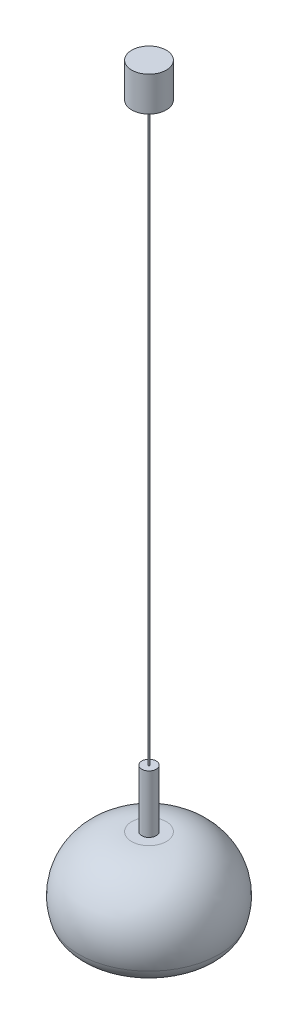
ISO-10303-21;
HEADER;
FILE_DESCRIPTION(('STEP AP214'),'2;1');
FILE_NAME('part.step','',(''),(''),'','','');
FILE_SCHEMA(('AUTOMOTIVE_DESIGN { 1 0 10303 214 1 1 1 1 }'));
ENDSEC;
DATA;
#1=APPLICATION_CONTEXT('core data for automotive mechanical design processes');
#2=APPLICATION_PROTOCOL_DEFINITION('international standard','automotive_design',2000,#1);
#3=PRODUCT_CONTEXT('',#1,'mechanical');
#4=PRODUCT('Part','Part','',(#3));
#5=PRODUCT_RELATED_PRODUCT_CATEGORY('part','',(#4));
#6=PRODUCT_DEFINITION_FORMATION('','',#4);
#7=PRODUCT_DEFINITION_CONTEXT('part definition',#1,'design');
#8=PRODUCT_DEFINITION('design','',#6,#7);
#9=PRODUCT_DEFINITION_SHAPE('','',#8);
#10=(LENGTH_UNIT() NAMED_UNIT(*) SI_UNIT(.MILLI.,.METRE.));
#11=(NAMED_UNIT(*) PLANE_ANGLE_UNIT() SI_UNIT($,.RADIAN.));
#12=(NAMED_UNIT(*) SI_UNIT($,.STERADIAN.) SOLID_ANGLE_UNIT());
#13=UNCERTAINTY_MEASURE_WITH_UNIT(LENGTH_MEASURE(1.E-05),#10,'distance_accuracy_value','');
#14=(GEOMETRIC_REPRESENTATION_CONTEXT(3) GLOBAL_UNCERTAINTY_ASSIGNED_CONTEXT((#13)) GLOBAL_UNIT_ASSIGNED_CONTEXT((#10,
#11,#12)) REPRESENTATION_CONTEXT('',''));
#15=CARTESIAN_POINT('',(0.,0.,0.));
#16=DIRECTION('',(0.,0.,1.));
#17=DIRECTION('',(1.,0.,0.));
#18=AXIS2_PLACEMENT_3D('',#15,#16,#17);
#19=CARTESIAN_POINT('',(-13.9638529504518,21.1647534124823,251.88578006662));
#20=DIRECTION('',(0.,0.,-1.));
#21=DIRECTION('',(-1.,0.,0.));
#22=AXIS2_PLACEMENT_3D('',#19,#20,#21);
#23=CIRCLE('',#22,40.);
#24=TRIMMED_CURVE('',#23,(PARAMETER_VALUE(-1.61579062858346)),
(PARAMETER_VALUE(1.61579062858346)),.T.,.PARAMETER.);
#25=CARTESIAN_POINT('',(-12.1646880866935,21.1647534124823,251.88578006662));
#26=DIRECTION('',(0.,1.,0.));
#27=AXIS1_PLACEMENT('',#25,#26);
#28=SURFACE_OF_REVOLUTION('',#24,#27);
#29=CARTESIAN_POINT('',(-12.1646880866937,59.1303600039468,251.88578006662));
#30=DIRECTION('',(0.,1.,0.));
#31=DIRECTION('',(-1.,0.,0.));
#32=AXIS2_PLACEMENT_3D('',#29,#30,#31);
#33=CIRCLE('',#32,14.3933189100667);
#34=CARTESIAN_POINT('',(-26.5580069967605,59.1303600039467,251.88578006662));
#35=VERTEX_POINT('',#34);
#36=EDGE_CURVE('P0_E11',#35,#35,#33,.T.);
#37=ORIENTED_EDGE('',*,*,#36,.F.);
#38=EDGE_LOOP('',(#37));
#39=FACE_BOUND('',#38,.T.);
#40=CARTESIAN_POINT('',(-12.1646880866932,-18.7947636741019,251.88578006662));
#41=VERTEX_POINT('',#40);
#42=VERTEX_LOOP('',#41);
#43=FACE_BOUND('',#42,.T.);
#44=ADVANCED_FACE('P0_F17',(#39,#43),#28,.T.);
#45=CARTESIAN_POINT('',(2.22863082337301,59.1303600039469,251.88578006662));
#46=DIRECTION('',(0.,-1.,0.));
#47=DIRECTION('',(1.,0.,0.));
#48=AXIS2_PLACEMENT_3D('',#45,#46,#47);
#49=PLANE('',#48);
#50=ORIENTED_EDGE('',*,*,#36,.T.);
#51=EDGE_LOOP('',(#50));
#52=FACE_BOUND('',#51,.T.);
#53=ADVANCED_FACE('P0_F25',(#52),#49,.F.);
#54=CLOSED_SHELL('',(#44,#53));
#55=MANIFOLD_SOLID_BREP('P0_B1',#54);
#56=CARTESIAN_POINT('',(-12.1646880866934,101.130360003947,251.88578006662));
#57=DIRECTION('',(0.,1.,0.));
#58=DIRECTION('',(-1.,0.,0.));
#59=AXIS2_PLACEMENT_3D('',#56,#57,#58);
#60=PLANE('',#59);
#61=CARTESIAN_POINT('',(-12.1646880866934,101.130360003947,251.88578006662));
#62=DIRECTION('',(0.,1.,0.));
#63=DIRECTION('',(0.,0.,1.));
#64=AXIS2_PLACEMENT_3D('',#61,#62,#63);
#65=CIRCLE('',#64,12.5);
#66=CARTESIAN_POINT('',(-12.1646880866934,101.130360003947,264.38578006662));
#67=VERTEX_POINT('',#66);
#68=EDGE_CURVE('P1_E40',#67,#67,#65,.T.);
#69=ORIENTED_EDGE('',*,*,#68,.F.);
#70=EDGE_LOOP('',(#69));
#71=FACE_BOUND('',#70,.T.);
#72=CARTESIAN_POINT('',(-12.1646880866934,101.130360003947,251.88578006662));
#73=DIRECTION('',(0.,-1.,0.));
#74=DIRECTION('',(1.,0.,0.));
#75=AXIS2_PLACEMENT_3D('',#72,#73,#74);
#76=CIRCLE('',#75,30.);
#77=CARTESIAN_POINT('',(17.8353119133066,101.130360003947,251.88578006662));
#78=VERTEX_POINT('',#77);
#79=EDGE_CURVE('P1_E10',#78,#78,#76,.T.);
#80=ORIENTED_EDGE('',*,*,#79,.F.);
#81=EDGE_LOOP('',(#80));
#82=FACE_BOUND('',#81,.T.);
#83=ADVANCED_FACE('P1_F15',(#71,#82),#60,.T.);
#84=CARTESIAN_POINT('',(-12.1646880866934,5.18746997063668,251.88578006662));
#85=DIRECTION('',(0.,-1.,0.));
#86=DIRECTION('',(1.,0.,0.));
#87=AXIS2_PLACEMENT_3D('',#84,#85,#86);
#88=DEGENERATE_TOROIDAL_SURFACE('',#87,30.,95.9428900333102,.T.);
#89=ORIENTED_EDGE('',*,*,#79,.T.);
#90=EDGE_LOOP('',(#89));
#91=FACE_BOUND('',#90,.T.);
#92=CARTESIAN_POINT('',(-12.1646880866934,-22.6792566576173,251.88578006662));
#93=DIRECTION('',(0.,-1.,0.));
#94=DIRECTION('',(1.,0.,0.));
#95=AXIS2_PLACEMENT_3D('',#92,#93,#94);
#96=CIRCLE('',#95,121.806773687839);
#97=CARTESIAN_POINT('',(109.642085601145,-22.6792566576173,251.88578006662));
#98=VERTEX_POINT('',#97);
#99=EDGE_CURVE('P1_E22',#98,#98,#96,.T.);
#100=ORIENTED_EDGE('',*,*,#99,.F.);
#101=EDGE_LOOP('',(#100));
#102=FACE_BOUND('',#101,.T.);
#103=ADVANCED_FACE('P1_F68',(#91,#102),#88,.T.);
#104=CARTESIAN_POINT('',(-12.1646880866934,-11.0612090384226,251.88578006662));
#105=DIRECTION('',(0.,-1.,0.));
#106=DIRECTION('',(1.,0.,0.));
#107=AXIS2_PLACEMENT_3D('',#104,#105,#106);
#108=TOROIDAL_SURFACE('',#107,83.531181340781,40.0000000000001);
#109=ORIENTED_EDGE('',*,*,#99,.T.);
#110=EDGE_LOOP('',(#109));
#111=FACE_BOUND('',#110,.T.);
#112=CARTESIAN_POINT('',(-12.1646880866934,-51.0612090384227,251.88578006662));
#113=DIRECTION('',(0.,-1.,0.));
#114=DIRECTION('',(1.,0.,0.));
#115=AXIS2_PLACEMENT_3D('',#112,#113,#114);
#116=CIRCLE('',#115,83.531181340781);
#117=CARTESIAN_POINT('',(71.3664932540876,-51.0612090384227,251.88578006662));
#118=VERTEX_POINT('',#117);
#119=EDGE_CURVE('P1_E26',#118,#118,#116,.T.);
#120=ORIENTED_EDGE('',*,*,#119,.F.);
#121=EDGE_LOOP('',(#120));
#122=FACE_BOUND('',#121,.T.);
#123=ADVANCED_FACE('P1_F73',(#111,#122),#108,.T.);
#124=CARTESIAN_POINT('',(-12.1646880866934,-50.0612090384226,251.88578006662));
#125=DIRECTION('',(0.,-1.,0.));
#126=DIRECTION('',(1.,0.,0.));
#127=AXIS2_PLACEMENT_3D('',#124,#125,#126);
#128=TOROIDAL_SURFACE('',#127,83.531181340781,1.00000000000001);
#129=ORIENTED_EDGE('',*,*,#119,.T.);
#130=EDGE_LOOP('',(#129));
#131=FACE_BOUND('',#130,.T.);
#132=CARTESIAN_POINT('',(-12.1646880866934,-49.0612090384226,251.88578006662));
#133=DIRECTION('',(0.,-1.,0.));
#134=DIRECTION('',(1.,0.,0.));
#135=AXIS2_PLACEMENT_3D('',#132,#133,#134);
#136=CIRCLE('',#135,83.531181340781);
#137=CARTESIAN_POINT('',(71.3664932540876,-49.0612090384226,251.88578006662));
#138=VERTEX_POINT('',#137);
#139=EDGE_CURVE('P1_E31',#138,#138,#136,.T.);
#140=ORIENTED_EDGE('',*,*,#139,.F.);
#141=EDGE_LOOP('',(#140));
#142=FACE_BOUND('',#141,.T.);
#143=ADVANCED_FACE('P1_F64',(#131,#142),#128,.T.);
#144=CARTESIAN_POINT('',(-12.1646880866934,-11.0612090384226,251.88578006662));
#145=DIRECTION('',(0.,-1.,0.));
#146=DIRECTION('',(1.,0.,0.));
#147=AXIS2_PLACEMENT_3D('',#144,#145,#146);
#148=TOROIDAL_SURFACE('',#147,83.531181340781,38.0000000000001);
#149=ORIENTED_EDGE('',*,*,#139,.T.);
#150=EDGE_LOOP('',(#149));
#151=FACE_BOUND('',#150,.T.);
#152=CARTESIAN_POINT('',(-12.1646880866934,-22.0983542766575,251.88578006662));
#153=DIRECTION('',(0.,-1.,0.));
#154=DIRECTION('',(1.,0.,0.));
#155=AXIS2_PLACEMENT_3D('',#152,#153,#154);
#156=CIRCLE('',#155,119.892994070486);
#157=CARTESIAN_POINT('',(107.728305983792,-22.0983542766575,251.88578006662));
#158=VERTEX_POINT('',#157);
#159=EDGE_CURVE('P1_E34',#158,#158,#156,.T.);
#160=ORIENTED_EDGE('',*,*,#159,.F.);
#161=EDGE_LOOP('',(#160));
#162=FACE_BOUND('',#161,.T.);
#163=ADVANCED_FACE('P1_F57',(#151,#162),#148,.F.);
#164=CARTESIAN_POINT('',(-12.1646880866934,5.18746997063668,251.88578006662));
#165=DIRECTION('',(0.,-1.,0.));
#166=DIRECTION('',(1.,0.,0.));
#167=AXIS2_PLACEMENT_3D('',#164,#165,#166);
#168=DEGENERATE_TOROIDAL_SURFACE('',#167,30.,93.9428900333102,.T.);
#169=ORIENTED_EDGE('',*,*,#159,.T.);
#170=EDGE_LOOP('',(#169));
#171=FACE_BOUND('',#170,.T.);
#172=CARTESIAN_POINT('',(-12.1646880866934,99.1303600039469,251.88578006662));
#173=DIRECTION('',(0.,-1.,0.));
#174=DIRECTION('',(1.,0.,0.));
#175=AXIS2_PLACEMENT_3D('',#172,#173,#174);
#176=CIRCLE('',#175,30.);
#177=CARTESIAN_POINT('',(17.8353119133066,99.1303600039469,251.88578006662));
#178=VERTEX_POINT('',#177);
#179=EDGE_CURVE('P1_E37',#178,#178,#176,.T.);
#180=ORIENTED_EDGE('',*,*,#179,.F.);
#181=EDGE_LOOP('',(#180));
#182=FACE_BOUND('',#181,.T.);
#183=ADVANCED_FACE('P1_F52',(#171,#182),#168,.F.);
#184=CARTESIAN_POINT('',(-12.1646880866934,99.1303600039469,251.88578006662));
#185=DIRECTION('',(0.,-1.,0.));
#186=DIRECTION('',(1.,0.,0.));
#187=AXIS2_PLACEMENT_3D('',#184,#185,#186);
#188=PLANE('',#187);
#189=CARTESIAN_POINT('',(-12.1646880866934,99.1303600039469,251.88578006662));
#190=DIRECTION('',(0.,-1.,0.));
#191=DIRECTION('',(1.,0.,0.));
#192=AXIS2_PLACEMENT_3D('',#189,#190,#191);
#193=CIRCLE('',#192,12.5);
#194=CARTESIAN_POINT('',(0.335311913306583,99.1303600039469,251.88578006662));
#195=VERTEX_POINT('',#194);
#196=EDGE_CURVE('P1_E18',#195,#195,#193,.T.);
#197=ORIENTED_EDGE('',*,*,#196,.F.);
#198=EDGE_LOOP('',(#197));
#199=FACE_BOUND('',#198,.T.);
#200=ORIENTED_EDGE('',*,*,#179,.T.);
#201=EDGE_LOOP('',(#200));
#202=FACE_BOUND('',#201,.T.);
#203=ADVANCED_FACE('P1_F49',(#199,#202),#188,.T.);
#204=CARTESIAN_POINT('',(-12.1646880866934,69.1303600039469,251.88578006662));
#205=DIRECTION('',(0.,1.,0.));
#206=DIRECTION('',(0.,0.,1.));
#207=AXIS2_PLACEMENT_3D('',#204,#205,#206);
#208=CYLINDRICAL_SURFACE('',#207,12.5);
#209=ORIENTED_EDGE('',*,*,#196,.T.);
#210=EDGE_LOOP('',(#209));
#211=FACE_BOUND('',#210,.T.);
#212=ORIENTED_EDGE('',*,*,#68,.T.);
#213=EDGE_LOOP('',(#212));
#214=FACE_BOUND('',#213,.T.);
#215=ADVANCED_FACE('P1_F47',(#211,#214),#208,.F.);
#216=CLOSED_SHELL('',(#83,#103,#123,#143,#163,#183,#203,#215));
#217=MANIFOLD_SOLID_BREP('P1_B1',#216);
#218=CARTESIAN_POINT('',(-12.1646880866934,1261.13036000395,251.88578006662));
#219=DIRECTION('',(0.,-1.,0.));
#220=DIRECTION('',(0.,0.,-1.));
#221=AXIS2_PLACEMENT_3D('',#218,#219,#220);
#222=CYLINDRICAL_SURFACE('',#221,30.);
#223=CARTESIAN_POINT('',(-12.1646880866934,1261.13036000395,251.88578006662));
#224=DIRECTION('',(0.,1.,0.));
#225=DIRECTION('',(0.,0.,1.));
#226=AXIS2_PLACEMENT_3D('',#223,#224,#225);
#227=CIRCLE('',#226,30.);
#228=CARTESIAN_POINT('',(-12.1646880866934,1261.13036000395,281.88578006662));
#229=VERTEX_POINT('',#228);
#230=EDGE_CURVE('P2_E9',#229,#229,#227,.T.);
#231=ORIENTED_EDGE('',*,*,#230,.F.);
#232=EDGE_LOOP('',(#231));
#233=FACE_BOUND('',#232,.T.);
#234=CARTESIAN_POINT('',(-12.1646880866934,1201.13036000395,251.88578006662));
#235=DIRECTION('',(0.,1.,0.));
#236=DIRECTION('',(0.,0.,1.));
#237=AXIS2_PLACEMENT_3D('',#234,#235,#236);
#238=CIRCLE('',#237,30.);
#239=CARTESIAN_POINT('',(-12.1646880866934,1201.13036000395,281.88578006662));
#240=VERTEX_POINT('',#239);
#241=EDGE_CURVE('P2_E17',#240,#240,#238,.T.);
#242=ORIENTED_EDGE('',*,*,#241,.T.);
#243=EDGE_LOOP('',(#242));
#244=FACE_BOUND('',#243,.T.);
#245=ADVANCED_FACE('P2_F14',(#233,#244),#222,.T.);
#246=CARTESIAN_POINT('',(-12.1646880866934,1261.13036000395,251.88578006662));
#247=DIRECTION('',(0.,1.,0.));
#248=DIRECTION('',(0.,0.,1.));
#249=AXIS2_PLACEMENT_3D('',#246,#247,#248);
#250=PLANE('',#249);
#251=ORIENTED_EDGE('',*,*,#230,.T.);
#252=EDGE_LOOP('',(#251));
#253=FACE_BOUND('',#252,.T.);
#254=ADVANCED_FACE('P2_F29',(#253),#250,.T.);
#255=CARTESIAN_POINT('',(-12.1646880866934,1201.13036000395,251.88578006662));
#256=DIRECTION('',(0.,1.,0.));
#257=DIRECTION('',(0.,0.,1.));
#258=AXIS2_PLACEMENT_3D('',#255,#256,#257);
#259=PLANE('',#258);
#260=ORIENTED_EDGE('',*,*,#241,.F.);
#261=EDGE_LOOP('',(#260));
#262=FACE_BOUND('',#261,.T.);
#263=ADVANCED_FACE('P2_F27',(#262),#259,.F.);
#264=CLOSED_SHELL('',(#245,#254,#263));
#265=MANIFOLD_SOLID_BREP('P2_B1',#264);
#266=CARTESIAN_POINT('',(-12.1646880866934,1201.13036000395,251.88578006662));
#267=DIRECTION('',(0.,-1.,0.));
#268=DIRECTION('',(0.,0.,-1.));
#269=AXIS2_PLACEMENT_3D('',#266,#267,#268);
#270=CYLINDRICAL_SURFACE('',#269,1.5);
#271=CARTESIAN_POINT('',(-12.1646880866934,1201.13036000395,251.88578006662));
#272=DIRECTION('',(0.,1.,0.));
#273=DIRECTION('',(0.,0.,1.));
#274=AXIS2_PLACEMENT_3D('',#271,#272,#273);
#275=CIRCLE('',#274,1.5);
#276=CARTESIAN_POINT('',(-12.1646880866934,1201.13036000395,253.38578006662));
#277=VERTEX_POINT('',#276);
#278=EDGE_CURVE('P3_E10',#277,#277,#275,.T.);
#279=ORIENTED_EDGE('',*,*,#278,.F.);
#280=EDGE_LOOP('',(#279));
#281=FACE_BOUND('',#280,.T.);
#282=CARTESIAN_POINT('',(-12.1646880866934,201.130360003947,251.88578006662));
#283=DIRECTION('',(0.,1.,0.));
#284=DIRECTION('',(0.,0.,1.));
#285=AXIS2_PLACEMENT_3D('',#282,#283,#284);
#286=CIRCLE('',#285,1.5);
#287=CARTESIAN_POINT('',(-12.1646880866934,201.130360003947,253.38578006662));
#288=VERTEX_POINT('',#287);
#289=EDGE_CURVE('P3_E18',#288,#288,#286,.T.);
#290=ORIENTED_EDGE('',*,*,#289,.T.);
#291=EDGE_LOOP('',(#290));
#292=FACE_BOUND('',#291,.T.);
#293=ADVANCED_FACE('P3_F15',(#281,#292),#270,.T.);
#294=CARTESIAN_POINT('',(-12.1646880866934,1201.13036000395,251.88578006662));
#295=DIRECTION('',(0.,1.,0.));
#296=DIRECTION('',(0.,0.,1.));
#297=AXIS2_PLACEMENT_3D('',#294,#295,#296);
#298=PLANE('',#297);
#299=ORIENTED_EDGE('',*,*,#278,.T.);
#300=EDGE_LOOP('',(#299));
#301=FACE_BOUND('',#300,.T.);
#302=ADVANCED_FACE('P3_F30',(#301),#298,.T.);
#303=CARTESIAN_POINT('',(-12.1646880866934,201.130360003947,251.88578006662));
#304=DIRECTION('',(0.,1.,0.));
#305=DIRECTION('',(0.,0.,1.));
#306=AXIS2_PLACEMENT_3D('',#303,#304,#305);
#307=PLANE('',#306);
#308=ORIENTED_EDGE('',*,*,#289,.F.);
#309=EDGE_LOOP('',(#308));
#310=FACE_BOUND('',#309,.T.);
#311=ADVANCED_FACE('P3_F28',(#310),#307,.F.);
#312=CLOSED_SHELL('',(#293,#302,#311));
#313=MANIFOLD_SOLID_BREP('P3_B1',#312);
#314=CARTESIAN_POINT('',(-12.1646880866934,201.130360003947,251.88578006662));
#315=DIRECTION('',(0.,-1.,0.));
#316=DIRECTION('',(0.,0.,-1.));
#317=AXIS2_PLACEMENT_3D('',#314,#315,#316);
#318=CYLINDRICAL_SURFACE('',#317,12.5);
#319=CARTESIAN_POINT('',(-12.1646880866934,201.130360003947,251.88578006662));
#320=DIRECTION('',(0.,1.,0.));
#321=DIRECTION('',(0.,0.,1.));
#322=AXIS2_PLACEMENT_3D('',#319,#320,#321);
#323=CIRCLE('',#322,12.5);
#324=CARTESIAN_POINT('',(-12.1646880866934,201.130360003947,264.38578006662));
#325=VERTEX_POINT('',#324);
#326=EDGE_CURVE('P4_E10',#325,#325,#323,.T.);
#327=ORIENTED_EDGE('',*,*,#326,.F.);
#328=EDGE_LOOP('',(#327));
#329=FACE_BOUND('',#328,.T.);
#330=CARTESIAN_POINT('',(-12.1646880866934,101.130360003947,251.88578006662));
#331=DIRECTION('',(0.,1.,0.));
#332=DIRECTION('',(0.,0.,1.));
#333=AXIS2_PLACEMENT_3D('',#330,#331,#332);
#334=CIRCLE('',#333,12.5);
#335=CARTESIAN_POINT('',(-12.1646880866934,101.130360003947,264.38578006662));
#336=VERTEX_POINT('',#335);
#337=EDGE_CURVE('P4_E18',#336,#336,#334,.T.);
#338=ORIENTED_EDGE('',*,*,#337,.T.);
#339=EDGE_LOOP('',(#338));
#340=FACE_BOUND('',#339,.T.);
#341=ADVANCED_FACE('P4_F15',(#329,#340),#318,.T.);
#342=CARTESIAN_POINT('',(-12.1646880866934,201.130360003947,251.88578006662));
#343=DIRECTION('',(0.,1.,0.));
#344=DIRECTION('',(0.,0.,1.));
#345=AXIS2_PLACEMENT_3D('',#342,#343,#344);
#346=PLANE('',#345);
#347=ORIENTED_EDGE('',*,*,#326,.T.);
#348=EDGE_LOOP('',(#347));
#349=FACE_BOUND('',#348,.T.);
#350=ADVANCED_FACE('P4_F30',(#349),#346,.T.);
#351=CARTESIAN_POINT('',(-12.1646880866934,101.130360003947,251.88578006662));
#352=DIRECTION('',(0.,1.,0.));
#353=DIRECTION('',(0.,0.,1.));
#354=AXIS2_PLACEMENT_3D('',#351,#352,#353);
#355=PLANE('',#354);
#356=ORIENTED_EDGE('',*,*,#337,.F.);
#357=EDGE_LOOP('',(#356));
#358=FACE_BOUND('',#357,.T.);
#359=ADVANCED_FACE('P4_F28',(#358),#355,.F.);
#360=CLOSED_SHELL('',(#341,#350,#359));
#361=MANIFOLD_SOLID_BREP('P4_B1',#360);
#362=CARTESIAN_POINT('',(-12.1646880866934,94.1303600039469,251.88578006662));
#363=DIRECTION('',(0.,1.,0.));
#364=DIRECTION('',(0.,0.,1.));
#365=AXIS2_PLACEMENT_3D('',#362,#363,#364);
#366=CYLINDRICAL_SURFACE('',#365,55.);
#367=CARTESIAN_POINT('',(-12.1646880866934,94.1303600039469,251.88578006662));
#368=DIRECTION('',(0.,-1.,0.));
#369=DIRECTION('',(0.,0.,-1.));
#370=AXIS2_PLACEMENT_3D('',#367,#368,#369);
#371=CIRCLE('',#370,55.);
#372=CARTESIAN_POINT('',(-12.1646880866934,94.1303600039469,196.88578006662));
#373=VERTEX_POINT('',#372);
#374=EDGE_CURVE('P5_E10',#373,#373,#371,.T.);
#375=ORIENTED_EDGE('',*,*,#374,.F.);
#376=EDGE_LOOP('',(#375));
#377=FACE_BOUND('',#376,.T.);
#378=CARTESIAN_POINT('',(-12.1646880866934,96.1303600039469,251.88578006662));
#379=DIRECTION('',(0.,-1.,0.));
#380=DIRECTION('',(0.,0.,-1.));
#381=AXIS2_PLACEMENT_3D('',#378,#379,#380);
#382=CIRCLE('',#381,55.);
#383=CARTESIAN_POINT('',(-12.1646880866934,96.1303600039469,196.88578006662));
#384=VERTEX_POINT('',#383);
#385=EDGE_CURVE('P5_E22',#384,#384,#382,.T.);
#386=ORIENTED_EDGE('',*,*,#385,.T.);
#387=EDGE_LOOP('',(#386));
#388=FACE_BOUND('',#387,.T.);
#389=ADVANCED_FACE('P5_F15',(#377,#388),#366,.T.);
#390=CARTESIAN_POINT('',(-12.1646880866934,94.1303600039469,251.88578006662));
#391=DIRECTION('',(0.,-1.,0.));
#392=DIRECTION('',(0.,0.,-1.));
#393=AXIS2_PLACEMENT_3D('',#390,#391,#392);
#394=PLANE('',#393);
#395=CARTESIAN_POINT('',(-12.1646880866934,94.1303600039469,251.88578006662));
#396=DIRECTION('',(0.,-1.,0.));
#397=DIRECTION('',(0.,0.,-1.));
#398=AXIS2_PLACEMENT_3D('',#395,#396,#397);
#399=CIRCLE('',#398,12.5);
#400=CARTESIAN_POINT('',(-12.1646880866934,94.1303600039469,239.38578006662));
#401=VERTEX_POINT('',#400);
#402=EDGE_CURVE('P5_E27',#401,#401,#399,.T.);
#403=ORIENTED_EDGE('',*,*,#402,.F.);
#404=EDGE_LOOP('',(#403));
#405=FACE_BOUND('',#404,.T.);
#406=ORIENTED_EDGE('',*,*,#374,.T.);
#407=EDGE_LOOP('',(#406));
#408=FACE_BOUND('',#407,.T.);
#409=ADVANCED_FACE('P5_F45',(#405,#408),#394,.T.);
#410=CARTESIAN_POINT('',(-12.1646880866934,96.1303600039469,251.88578006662));
#411=DIRECTION('',(0.,-1.,0.));
#412=DIRECTION('',(0.,0.,-1.));
#413=AXIS2_PLACEMENT_3D('',#410,#411,#412);
#414=PLANE('',#413);
#415=CARTESIAN_POINT('',(-12.1646880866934,96.1303600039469,251.88578006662));
#416=DIRECTION('',(0.,-1.,0.));
#417=DIRECTION('',(0.,0.,-1.));
#418=AXIS2_PLACEMENT_3D('',#415,#416,#417);
#419=CIRCLE('',#418,12.5);
#420=CARTESIAN_POINT('',(-12.1646880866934,96.1303600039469,239.38578006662));
#421=VERTEX_POINT('',#420);
#422=EDGE_CURVE('P5_E18',#421,#421,#419,.T.);
#423=ORIENTED_EDGE('',*,*,#422,.T.);
#424=EDGE_LOOP('',(#423));
#425=FACE_BOUND('',#424,.T.);
#426=ORIENTED_EDGE('',*,*,#385,.F.);
#427=EDGE_LOOP('',(#426));
#428=FACE_BOUND('',#427,.T.);
#429=ADVANCED_FACE('P5_F35',(#425,#428),#414,.F.);
#430=CARTESIAN_POINT('',(-12.1646880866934,69.1303600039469,251.88578006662));
#431=DIRECTION('',(0.,1.,0.));
#432=DIRECTION('',(0.,0.,1.));
#433=AXIS2_PLACEMENT_3D('',#430,#431,#432);
#434=CYLINDRICAL_SURFACE('',#433,12.5);
#435=ORIENTED_EDGE('',*,*,#402,.T.);
#436=EDGE_LOOP('',(#435));
#437=FACE_BOUND('',#436,.T.);
#438=ORIENTED_EDGE('',*,*,#422,.F.);
#439=EDGE_LOOP('',(#438));
#440=FACE_BOUND('',#439,.T.);
#441=ADVANCED_FACE('P5_F38',(#437,#440),#434,.F.);
#442=CLOSED_SHELL('',(#389,#409,#429,#441));
#443=MANIFOLD_SOLID_BREP('P5_B1',#442);
#444=CARTESIAN_POINT('',(-12.1646880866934,59.1303600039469,251.88578006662));
#445=DIRECTION('',(0.,1.,0.));
#446=DIRECTION('',(0.,0.,1.));
#447=AXIS2_PLACEMENT_3D('',#444,#445,#446);
#448=CYLINDRICAL_SURFACE('',#447,12.5);
#449=CARTESIAN_POINT('',(-12.1646880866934,59.1303600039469,251.88578006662));
#450=DIRECTION('',(0.,-1.,0.));
#451=DIRECTION('',(0.,0.,-1.));
#452=AXIS2_PLACEMENT_3D('',#449,#450,#451);
#453=CIRCLE('',#452,12.5);
#454=CARTESIAN_POINT('',(-12.1646880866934,59.1303600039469,239.38578006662));
#455=VERTEX_POINT('',#454);
#456=EDGE_CURVE('P6_E10',#455,#455,#453,.T.);
#457=ORIENTED_EDGE('',*,*,#456,.F.);
#458=EDGE_LOOP('',(#457));
#459=FACE_BOUND('',#458,.T.);
#460=CARTESIAN_POINT('',(-12.1646880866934,94.1303600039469,251.88578006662));
#461=DIRECTION('',(0.,-1.,0.));
#462=DIRECTION('',(0.,0.,-1.));
#463=AXIS2_PLACEMENT_3D('',#460,#461,#462);
#464=CIRCLE('',#463,12.5);
#465=CARTESIAN_POINT('',(-12.1646880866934,94.1303600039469,239.38578006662));
#466=VERTEX_POINT('',#465);
#467=EDGE_CURVE('P6_E18',#466,#466,#464,.T.);
#468=ORIENTED_EDGE('',*,*,#467,.T.);
#469=EDGE_LOOP('',(#468));
#470=FACE_BOUND('',#469,.T.);
#471=ADVANCED_FACE('P6_F15',(#459,#470),#448,.T.);
#472=CARTESIAN_POINT('',(-12.1646880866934,59.1303600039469,251.88578006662));
#473=DIRECTION('',(0.,-1.,0.));
#474=DIRECTION('',(0.,0.,-1.));
#475=AXIS2_PLACEMENT_3D('',#472,#473,#474);
#476=PLANE('',#475);
#477=ORIENTED_EDGE('',*,*,#456,.T.);
#478=EDGE_LOOP('',(#477));
#479=FACE_BOUND('',#478,.T.);
#480=ADVANCED_FACE('P6_F30',(#479),#476,.T.);
#481=CARTESIAN_POINT('',(-12.1646880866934,94.1303600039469,251.88578006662));
#482=DIRECTION('',(0.,-1.,0.));
#483=DIRECTION('',(0.,0.,-1.));
#484=AXIS2_PLACEMENT_3D('',#481,#482,#483);
#485=PLANE('',#484);
#486=ORIENTED_EDGE('',*,*,#467,.F.);
#487=EDGE_LOOP('',(#486));
#488=FACE_BOUND('',#487,.T.);
#489=ADVANCED_FACE('P6_F28',(#488),#485,.F.);
#490=CLOSED_SHELL('',(#471,#480,#489));
#491=MANIFOLD_SOLID_BREP('P6_B1',#490);
#492=ADVANCED_BREP_SHAPE_REPRESENTATION('',(#18,#55,#217,#265,#313,#361,#443,#491),#14);
#493=SHAPE_DEFINITION_REPRESENTATION(#9,#492);
ENDSEC;
END-ISO-10303-21;
